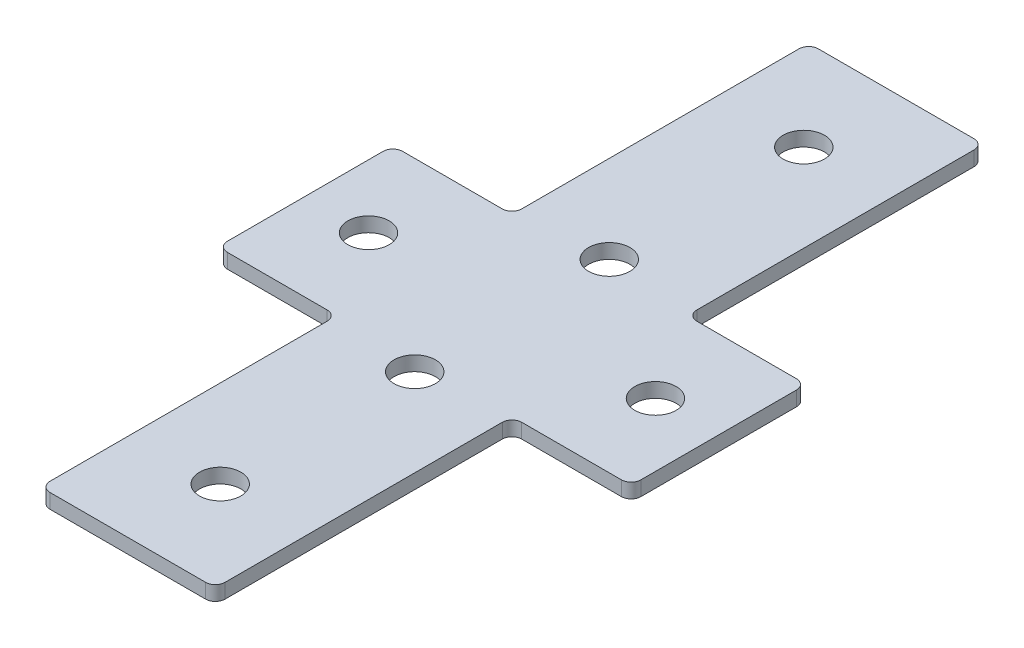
from build123d import *

# Parameters (mm, degrees)
SKETCH_1_R      = 4.25
EXTRUDE_1_DEPTH = 3
FILLET_1_R      = 2


with BuildPart() as part:
    # Sketch 1 → Extrude 1 (new body)
    with BuildSketch(Plane(origin=(0, 0, 0), x_dir=(1, 0, 0), z_dir=(0, 1, 0))):
        Polygon((-18, 79), (18, 79), (18, 18), (42.5, 18), (42.5, -18), (18, -18), (18, -79), (-18, -79), (-18, -18), (-42.5, -18), (-42.5, 18), (-18, 18), align=None)
        with Locations(Location((0, 60, 0), (0, 0, 270))):
            Circle(SKETCH_1_R, mode=Mode.SUBTRACT)
        with Locations(Location((0, 20, 0), (0, 0, 270))):
            Circle(SKETCH_1_R, mode=Mode.SUBTRACT)
        with Locations(Location((0, -20, 0), (0, 0, 90))):
            Circle(SKETCH_1_R, mode=Mode.SUBTRACT)
        with Locations(Location((0, -60, 0), (0, 0, 90))):
            Circle(SKETCH_1_R, mode=Mode.SUBTRACT)
        with Locations(Location((-29.5, 0, 0), (0, 0, 270))):
            Circle(SKETCH_1_R, mode=Mode.SUBTRACT)
        with Locations(Location((29.5, 0, 0), (0, 0, 90))):
            Circle(SKETCH_1_R, mode=Mode.SUBTRACT)
    extrude(amount=EXTRUDE_1_DEPTH)

    # Fillet 1
    fillet_1_edges = [part.edges().sort_by_distance(p)[0] for p in [
        (-18, 1.5, -18),
        (-18, 1.5, -79),
        (18, 1.5, -79),
        (18, 1.5, -18),
        (42.5, 1.5, -18),
        (42.5, 1.5, 18),
        (18, 1.5, 18),
        (18, 1.5, 79),
        (-18, 1.5, 79),
        (-18, 1.5, 18),
        (-42.5, 1.5, 18),
        (-42.5, 1.5, -18),
    ]]
    fillet(fillet_1_edges, radius=FILLET_1_R)


solid = part.part
